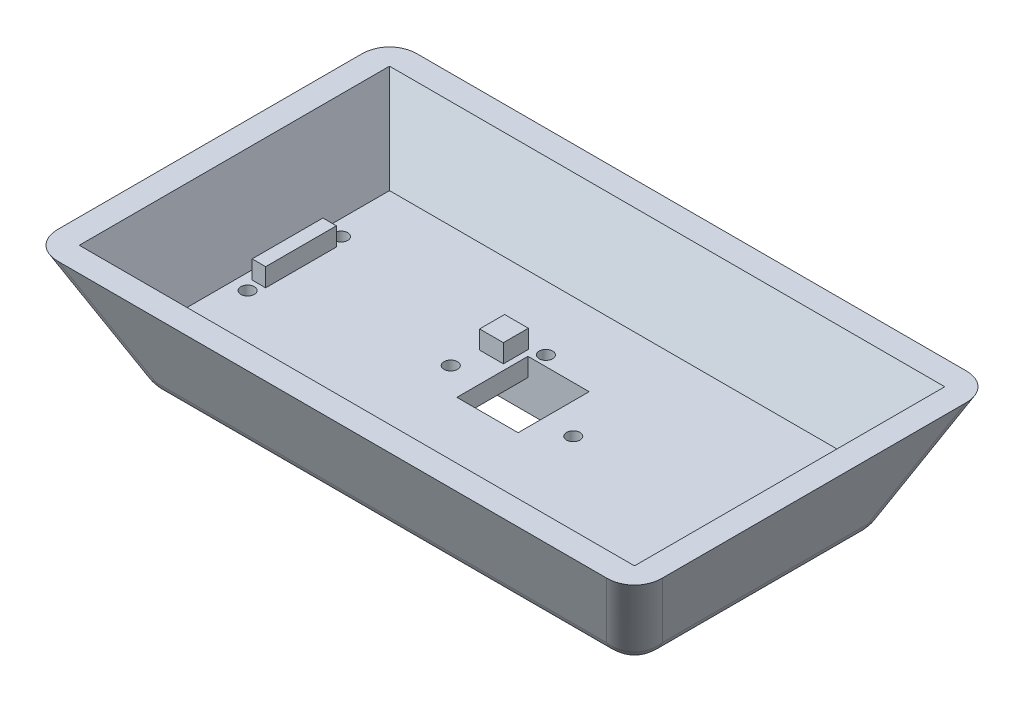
from build123d import *

# Parameters (mm, degrees)
SKETCH1_W           = 80
SKETCH1_H           = 40
BOSS_EXTRUDE1_DEPTH = 20
BOSS_EXTRUDE1_DRAFT = -25
SKETCH2_W           = 30.2
SKETCH2_H           = 15.2
CUT_EXTRUDE1_DEPTH  = 5
SKETCH3_W           = 90.652306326
SKETCH3_H           = 50.652306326
CUT_EXTRUDE3_DEPTH  = 12
CUT_EXTRUDE3_DRAFT  = -25
CUT_EXTRUDE4_REACH  = 61.314
SKETCH5_R           = 1.1
SKETCH5_W           = 10
SKETCH5_H           = 11.6
SKETCH6_R           = 1.1
CUT_EXTRUDE5_DEPTH  = 4.75
SKETCH7_W           = 2.2
SKETCH7_H           = 11.55
SKETCH7_W_2         = 3.881780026
SKETCH7_H_2         = 4.079158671
BOSS_EXTRUDE3_DEPTH = 3
FILLET1_R           = 5


with BuildPart() as part:
    # Sketch1 → Boss-Extrude1 (with draft: the straight prism first)
    with BuildSketch(Plane(origin=(0, 0, 0), x_dir=(1, 0, 0), z_dir=(0, 1, 0))):
        Rectangle(SKETCH1_W, SKETCH1_H)
    extrude(amount=BOSS_EXTRUDE1_DEPTH)
    # Boss-Extrude1: the draft: its side faces are tilted about the plane it starts from
    boss_extrude1_sides = [part.faces().sort_by_distance(p)[0] for p in [
        (-40, 10, 0),
        (0, 10, 20),
        (40, 10, 0),
        (0, 10, -20),
    ]]
    draft(boss_extrude1_sides, Plane(origin=(0, 0, 0), x_dir=(1, 0, 0), z_dir=(0, 1, 0)), BOSS_EXTRUDE1_DRAFT)

    # Sketch2 → Cut-Extrude1 (cut)
    with BuildSketch(Plane.XZ):
        Rectangle(SKETCH2_W, SKETCH2_H)
    extrude(amount=-CUT_EXTRUDE1_DEPTH, mode=Mode.SUBTRACT)


with BuildPart() as cut_extrude3_tool:
    # Sketch3 → Cut-Extrude3 (with draft: the straight prism first)
    with BuildSketch(Plane(origin=(0, 20, 0), x_dir=(1, 0, 0), z_dir=(0, 1, 0))):
        Rectangle(SKETCH3_W, SKETCH3_H)
    extrude(amount=-CUT_EXTRUDE3_DEPTH)
    # Cut-Extrude3: the draft: its side faces are tilted about the plane it starts from
    cut_extrude3_sides = [cut_extrude3_tool.faces().sort_by_distance(p)[0] for p in [
        (-45.326153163, 14, 0),
        (0, 14, 25.326153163),
        (45.326153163, 14, 0),
        (0, 14, -25.326153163),
    ]]
    draft(cut_extrude3_sides, Plane(origin=(0, 20, 0), x_dir=(1, 0, 0), z_dir=(0, 1, 0)), CUT_EXTRUDE3_DRAFT)


with BuildPart() as part_1:
    add(part.part)

    # Cut-Extrude3: cut by cut_extrude3_tool
    add(cut_extrude3_tool.part, mode=Mode.SUBTRACT)

    # Sketch5 → Cut-Extrude4 (cut, up to next)
    with BuildSketch(Plane.XZ.offset(-5), mode=Mode.PRIVATE) as cut_extrude4_sk1:
        with Locations(Location((-10, 0, 0), (0, 0, 270))):
            Circle(SKETCH5_R)
    cut_extrude4_tool1 = extrude(cut_extrude4_sk1.sketch, amount=-CUT_EXTRUDE4_REACH, mode=Mode.PRIVATE) & part_1.part
    # Sketch5 → Cut-Extrude4 (cut, up to next)
    with BuildSketch(Plane.XZ.offset(-5), mode=Mode.PRIVATE) as cut_extrude4_sk2:
        with Locations(Location((10, 0, 0), (0, 0, 270))):
            Circle(SKETCH5_R)
    cut_extrude4_tool2 = extrude(cut_extrude4_sk2.sketch, amount=-CUT_EXTRUDE4_REACH, mode=Mode.PRIVATE) & part_1.part
    # Sketch5 → Cut-Extrude4 (cut, up to next)
    with BuildSketch(Plane.XZ.offset(-5), mode=Mode.PRIVATE) as cut_extrude4_sk3:
        with Locations((0, -1.8)):
            Rectangle(SKETCH5_W, SKETCH5_H)
    cut_extrude4_tool3 = extrude(cut_extrude4_sk3.sketch, amount=-CUT_EXTRUDE4_REACH, mode=Mode.PRIVATE) & part_1.part
    add(cut_extrude4_tool1.solids().sort_by_distance((-10, 5, 0))[0], mode=Mode.SUBTRACT)
    add(cut_extrude4_tool2.solids().sort_by_distance((10, 5, 0))[0], mode=Mode.SUBTRACT)
    add(cut_extrude4_tool3.solids().sort_by_distance((0, 5, -1.8))[0], mode=Mode.SUBTRACT)

    # Sketch6 → Cut-Extrude5 (cut)
    with BuildSketch(Plane(origin=(0, 8, 0), x_dir=(1, 0, 0), z_dir=(0, 1, 0))):
        with Locations(Location((-37.190461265, -5.98, 0), (0, 0, 270))):
            Circle(SKETCH6_R)
        with Locations(Location((-37.190461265, 9.27, 0), (0, 0, 270))):
            Circle(SKETCH6_R)
        with Locations(Location((-3.730461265, 9.27, 0), (0, 0, 270))):
            Circle(SKETCH6_R)
    extrude(amount=-CUT_EXTRUDE5_DEPTH, mode=Mode.SUBTRACT)

    # Sketch7 → Boss-Extrude3 (add)
    with BuildSketch(Plane(origin=(0, 8, 0), x_dir=(1, 0, 0), z_dir=(0, 1, 0))):
        with Locations((-37.190461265, 1.645)):
            Rectangle(SKETCH7_W, SKETCH7_H)
        with Locations((-7.876757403, 6.569595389)):
            Rectangle(SKETCH7_W_2, SKETCH7_H_2)
    extrude(amount=BOSS_EXTRUDE3_DEPTH)

    # Fillet1
    fillet1_edges = [part_1.edges().sort_by_distance(p)[0] for p in [
        (0, 0, 20),
        (-40, 0, 0),
        (0, 0, -20),
        (40, 0, 0),
        (44.663076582, 10, 24.663076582),
        (-44.663076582, 10, 24.663076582),
        (-44.663076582, 10, -24.663076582),
        (44.663076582, 10, -24.663076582),
    ]]
    fillet(fillet1_edges, radius=FILLET1_R)


solid = part_1.part
